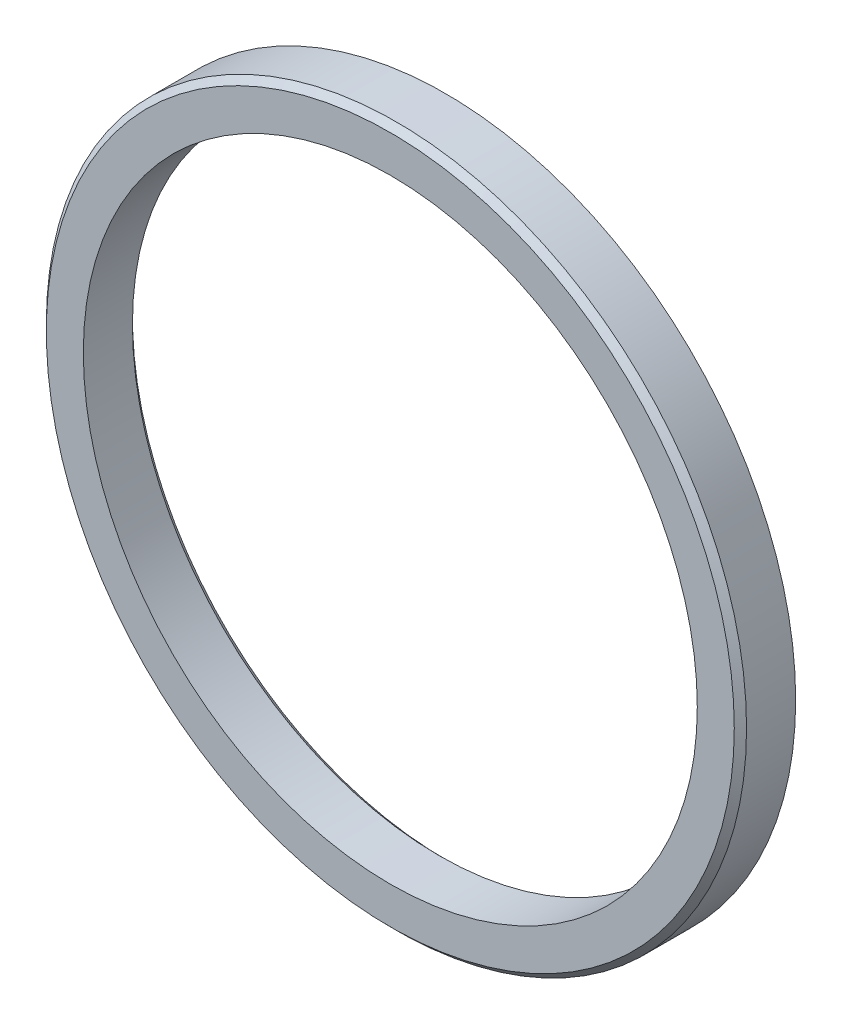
ISO-10303-21;
HEADER;
FILE_DESCRIPTION(('STEP AP214'),'2;1');
FILE_NAME('part.step','',(''),(''),'','','');
FILE_SCHEMA(('AUTOMOTIVE_DESIGN { 1 0 10303 214 1 1 1 1 }'));
ENDSEC;
DATA;
#1=APPLICATION_CONTEXT('core data for automotive mechanical design processes');
#2=APPLICATION_PROTOCOL_DEFINITION('international standard','automotive_design',2000,#1);
#3=PRODUCT_CONTEXT('',#1,'mechanical');
#4=PRODUCT('Part','Part','',(#3));
#5=PRODUCT_RELATED_PRODUCT_CATEGORY('part','',(#4));
#6=PRODUCT_DEFINITION_FORMATION('','',#4);
#7=PRODUCT_DEFINITION_CONTEXT('part definition',#1,'design');
#8=PRODUCT_DEFINITION('design','',#6,#7);
#9=PRODUCT_DEFINITION_SHAPE('','',#8);
#10=(LENGTH_UNIT() NAMED_UNIT(*) SI_UNIT(.MILLI.,.METRE.));
#11=(NAMED_UNIT(*) PLANE_ANGLE_UNIT() SI_UNIT($,.RADIAN.));
#12=(NAMED_UNIT(*) SI_UNIT($,.STERADIAN.) SOLID_ANGLE_UNIT());
#13=UNCERTAINTY_MEASURE_WITH_UNIT(LENGTH_MEASURE(1.E-05),#10,'distance_accuracy_value','');
#14=(GEOMETRIC_REPRESENTATION_CONTEXT(3) GLOBAL_UNCERTAINTY_ASSIGNED_CONTEXT((#13)) GLOBAL_UNIT_ASSIGNED_CONTEXT((#10,
#11,#12)) REPRESENTATION_CONTEXT('',''));
#15=CARTESIAN_POINT('',(0.,0.,0.));
#16=DIRECTION('',(0.,0.,1.));
#17=DIRECTION('',(1.,0.,0.));
#18=AXIS2_PLACEMENT_3D('',#15,#16,#17);
#19=CARTESIAN_POINT('',(0.,112.05,8.00000000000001));
#20=DIRECTION('',(0.,0.,-1.));
#21=DIRECTION('',(-1.,0.,0.));
#22=AXIS2_PLACEMENT_3D('',#19,#20,#21);
#23=PLANE('',#22);
#24=CARTESIAN_POINT('',(0.,0.,8.00000000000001));
#25=DIRECTION('',(0.,0.,1.));
#26=DIRECTION('',(1.,0.,0.));
#27=AXIS2_PLACEMENT_3D('',#24,#25,#26);
#28=CIRCLE('',#27,100.);
#29=CARTESIAN_POINT('',(100.,0.,8.00000000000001));
#30=VERTEX_POINT('',#29);
#31=EDGE_CURVE('E10',#30,#30,#28,.T.);
#32=ORIENTED_EDGE('',*,*,#31,.F.);
#33=EDGE_LOOP('',(#32));
#34=FACE_BOUND('',#33,.T.);
#35=CARTESIAN_POINT('',(0.,0.,8.00000000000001));
#36=DIRECTION('',(0.,0.,1.));
#37=DIRECTION('',(1.,0.,0.));
#38=AXIS2_PLACEMENT_3D('',#35,#36,#37);
#39=CIRCLE('',#38,112.05);
#40=CARTESIAN_POINT('',(112.05,0.,8.00000000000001));
#41=VERTEX_POINT('',#40);
#42=EDGE_CURVE('E53',#41,#41,#39,.T.);
#43=ORIENTED_EDGE('',*,*,#42,.T.);
#44=EDGE_LOOP('',(#43));
#45=FACE_BOUND('',#44,.T.);
#46=ADVANCED_FACE('F31',(#34,#45),#23,.F.);
#47=CARTESIAN_POINT('',(0.,0.,66.6227492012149));
#48=DIRECTION('',(0.,0.,1.));
#49=DIRECTION('',(1.,0.,0.));
#50=AXIS2_PLACEMENT_3D('',#47,#48,#49);
#51=CYLINDRICAL_SURFACE('',#50,100.);
#52=CARTESIAN_POINT('',(0.,0.,-8.00000000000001));
#53=DIRECTION('',(0.,0.,1.));
#54=DIRECTION('',(1.,0.,0.));
#55=AXIS2_PLACEMENT_3D('',#52,#53,#54);
#56=CIRCLE('',#55,100.);
#57=CARTESIAN_POINT('',(100.,0.,-8.00000000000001));
#58=VERTEX_POINT('',#57);
#59=EDGE_CURVE('E37',#58,#58,#56,.T.);
#60=ORIENTED_EDGE('',*,*,#59,.F.);
#61=EDGE_LOOP('',(#60));
#62=FACE_BOUND('',#61,.T.);
#63=ORIENTED_EDGE('',*,*,#31,.T.);
#64=EDGE_LOOP('',(#63));
#65=FACE_BOUND('',#64,.T.);
#66=ADVANCED_FACE('F78',(#62,#65),#51,.F.);
#67=CARTESIAN_POINT('',(0.,0.,-8.00000000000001));
#68=DIRECTION('',(0.,0.,-1.));
#69=DIRECTION('',(-1.,0.,0.));
#70=AXIS2_PLACEMENT_3D('',#67,#68,#69);
#71=CONICAL_SURFACE('',#70,100.,0.785398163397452);
#72=CARTESIAN_POINT('',(0.,0.,-9.99999999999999));
#73=DIRECTION('',(0.,0.,1.));
#74=DIRECTION('',(1.,0.,0.));
#75=AXIS2_PLACEMENT_3D('',#72,#73,#74);
#76=CIRCLE('',#75,102.);
#77=CARTESIAN_POINT('',(102.,0.,-9.99999999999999));
#78=VERTEX_POINT('',#77);
#79=EDGE_CURVE('E41',#78,#78,#76,.T.);
#80=ORIENTED_EDGE('',*,*,#79,.F.);
#81=EDGE_LOOP('',(#80));
#82=FACE_BOUND('',#81,.T.);
#83=ORIENTED_EDGE('',*,*,#59,.T.);
#84=EDGE_LOOP('',(#83));
#85=FACE_BOUND('',#84,.T.);
#86=ADVANCED_FACE('F73',(#82,#85),#71,.F.);
#87=CARTESIAN_POINT('',(0.,102.,-9.99999999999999));
#88=DIRECTION('',(0.,0.,1.));
#89=DIRECTION('',(1.,0.,0.));
#90=AXIS2_PLACEMENT_3D('',#87,#88,#89);
#91=PLANE('',#90);
#92=CARTESIAN_POINT('',(0.,0.,-9.99999999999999));
#93=DIRECTION('',(0.,0.,1.));
#94=DIRECTION('',(1.,0.,0.));
#95=AXIS2_PLACEMENT_3D('',#92,#93,#94);
#96=CIRCLE('',#95,114.05);
#97=CARTESIAN_POINT('',(114.05,0.,-9.99999999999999));
#98=VERTEX_POINT('',#97);
#99=EDGE_CURVE('E45',#98,#98,#96,.T.);
#100=ORIENTED_EDGE('',*,*,#99,.F.);
#101=EDGE_LOOP('',(#100));
#102=FACE_BOUND('',#101,.T.);
#103=ORIENTED_EDGE('',*,*,#79,.T.);
#104=EDGE_LOOP('',(#103));
#105=FACE_BOUND('',#104,.T.);
#106=ADVANCED_FACE('F67',(#102,#105),#91,.F.);
#107=CARTESIAN_POINT('',(0.,0.,66.6227492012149));
#108=DIRECTION('',(0.,0.,1.));
#109=DIRECTION('',(1.,0.,0.));
#110=AXIS2_PLACEMENT_3D('',#107,#108,#109);
#111=CYLINDRICAL_SURFACE('',#110,114.05);
#112=CARTESIAN_POINT('',(0.,0.,6.00000000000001));
#113=DIRECTION('',(0.,0.,1.));
#114=DIRECTION('',(1.,0.,0.));
#115=AXIS2_PLACEMENT_3D('',#112,#113,#114);
#116=CIRCLE('',#115,114.05);
#117=CARTESIAN_POINT('',(114.05,0.,6.00000000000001));
#118=VERTEX_POINT('',#117);
#119=EDGE_CURVE('E50',#118,#118,#116,.T.);
#120=ORIENTED_EDGE('',*,*,#119,.F.);
#121=EDGE_LOOP('',(#120));
#122=FACE_BOUND('',#121,.T.);
#123=ORIENTED_EDGE('',*,*,#99,.T.);
#124=EDGE_LOOP('',(#123));
#125=FACE_BOUND('',#124,.T.);
#126=ADVANCED_FACE('F61',(#122,#125),#111,.T.);
#127=CARTESIAN_POINT('',(0.,0.,6.00000000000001));
#128=DIRECTION('',(0.,0.,-1.));
#129=DIRECTION('',(-1.,0.,0.));
#130=AXIS2_PLACEMENT_3D('',#127,#128,#129);
#131=CONICAL_SURFACE('',#130,114.05,0.785398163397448);
#132=ORIENTED_EDGE('',*,*,#42,.F.);
#133=EDGE_LOOP('',(#132));
#134=FACE_BOUND('',#133,.T.);
#135=ORIENTED_EDGE('',*,*,#119,.T.);
#136=EDGE_LOOP('',(#135));
#137=FACE_BOUND('',#136,.T.);
#138=ADVANCED_FACE('F58',(#134,#137),#131,.T.);
#139=CLOSED_SHELL('',(#46,#66,#86,#106,#126,#138));
#140=MANIFOLD_SOLID_BREP('B2',#139);
#141=ADVANCED_BREP_SHAPE_REPRESENTATION('',(#18,#140),#14);
#142=SHAPE_DEFINITION_REPRESENTATION(#9,#141);
ENDSEC;
END-ISO-10303-21;
